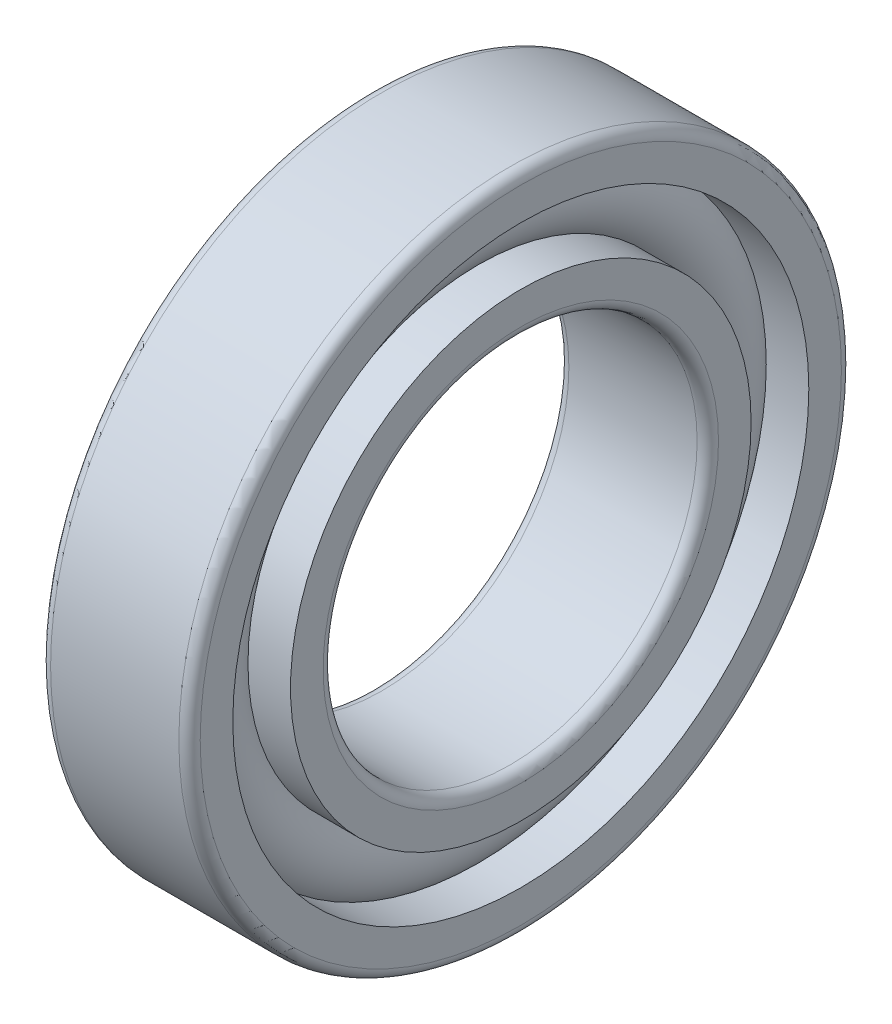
ISO-10303-21;
HEADER;
FILE_DESCRIPTION(('STEP AP214'),'2;1');
FILE_NAME('part.step','',(''),(''),'','','');
FILE_SCHEMA(('AUTOMOTIVE_DESIGN { 1 0 10303 214 1 1 1 1 }'));
ENDSEC;
DATA;
#1=APPLICATION_CONTEXT('core data for automotive mechanical design processes');
#2=APPLICATION_PROTOCOL_DEFINITION('international standard','automotive_design',2000,#1);
#3=PRODUCT_CONTEXT('',#1,'mechanical');
#4=PRODUCT('Part','Part','',(#3));
#5=PRODUCT_RELATED_PRODUCT_CATEGORY('part','',(#4));
#6=PRODUCT_DEFINITION_FORMATION('','',#4);
#7=PRODUCT_DEFINITION_CONTEXT('part definition',#1,'design');
#8=PRODUCT_DEFINITION('design','',#6,#7);
#9=PRODUCT_DEFINITION_SHAPE('','',#8);
#10=(LENGTH_UNIT() NAMED_UNIT(*) SI_UNIT(.MILLI.,.METRE.));
#11=(NAMED_UNIT(*) PLANE_ANGLE_UNIT() SI_UNIT($,.RADIAN.));
#12=(NAMED_UNIT(*) SI_UNIT($,.STERADIAN.) SOLID_ANGLE_UNIT());
#13=UNCERTAINTY_MEASURE_WITH_UNIT(LENGTH_MEASURE(1.E-05),#10,'distance_accuracy_value','');
#14=(GEOMETRIC_REPRESENTATION_CONTEXT(3) GLOBAL_UNCERTAINTY_ASSIGNED_CONTEXT((#13)) GLOBAL_UNIT_ASSIGNED_CONTEXT((#10,
#11,#12)) REPRESENTATION_CONTEXT('',''));
#15=CARTESIAN_POINT('',(0.,0.,0.));
#16=DIRECTION('',(0.,0.,1.));
#17=DIRECTION('',(1.,0.,0.));
#18=AXIS2_PLACEMENT_3D('',#15,#16,#17);
#19=CARTESIAN_POINT('',(0.,0.,0.));
#20=DIRECTION('',(-1.,0.,0.));
#21=DIRECTION('',(0.,0.,1.));
#22=AXIS2_PLACEMENT_3D('',#19,#20,#21);
#23=TOROIDAL_SURFACE('',#22,24.25,4.05);
#24=CARTESIAN_POINT('',(3.01869176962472,0.,0.));
#25=DIRECTION('',(-1.,0.,0.));
#26=DIRECTION('',(0.,0.,1.));
#27=AXIS2_PLACEMENT_3D('',#24,#25,#26);
#28=CIRCLE('',#27,26.95);
#29=CARTESIAN_POINT('',(3.01869176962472,0.,26.95));
#30=VERTEX_POINT('',#29);
#31=EDGE_CURVE('E33',#30,#30,#28,.F.);
#32=ORIENTED_EDGE('',*,*,#31,.T.);
#33=EDGE_LOOP('',(#32));
#34=FACE_BOUND('',#33,.T.);
#35=CARTESIAN_POINT('',(3.01869176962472,0.,0.));
#36=DIRECTION('',(-1.,0.,0.));
#37=DIRECTION('',(0.,0.,1.));
#38=AXIS2_PLACEMENT_3D('',#35,#36,#37);
#39=CIRCLE('',#38,21.55);
#40=CARTESIAN_POINT('',(3.01869176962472,0.,21.55));
#41=VERTEX_POINT('',#40);
#42=EDGE_CURVE('E10',#41,#41,#39,.T.);
#43=ORIENTED_EDGE('',*,*,#42,.T.);
#44=EDGE_LOOP('',(#43));
#45=FACE_BOUND('',#44,.T.);
#46=ADVANCED_FACE('F29',(#34,#45),#23,.T.);
#47=CARTESIAN_POINT('',(-20.6375,0.,0.));
#48=DIRECTION('',(1.,0.,0.));
#49=DIRECTION('',(0.,0.,-1.));
#50=AXIS2_PLACEMENT_3D('',#47,#48,#49);
#51=CYLINDRICAL_SURFACE('',#50,21.55);
#52=CARTESIAN_POINT('',(7.,0.,0.));
#53=DIRECTION('',(1.,0.,0.));
#54=DIRECTION('',(0.,0.,-1.));
#55=AXIS2_PLACEMENT_3D('',#52,#53,#54);
#56=CIRCLE('',#55,21.55);
#57=CARTESIAN_POINT('',(7.,0.,-21.55));
#58=VERTEX_POINT('',#57);
#59=EDGE_CURVE('E42',#58,#58,#56,.T.);
#60=ORIENTED_EDGE('',*,*,#59,.F.);
#61=EDGE_LOOP('',(#60));
#62=FACE_BOUND('',#61,.T.);
#63=ORIENTED_EDGE('',*,*,#42,.F.);
#64=EDGE_LOOP('',(#63));
#65=FACE_BOUND('',#64,.T.);
#66=ADVANCED_FACE('F81',(#62,#65),#51,.T.);
#67=CARTESIAN_POINT('',(-20.6375,0.,0.));
#68=DIRECTION('',(1.,0.,0.));
#69=DIRECTION('',(0.,0.,-1.));
#70=AXIS2_PLACEMENT_3D('',#67,#68,#69);
#71=CYLINDRICAL_SURFACE('',#70,21.55);
#72=CARTESIAN_POINT('',(-7.,0.,0.));
#73=DIRECTION('',(1.,0.,0.));
#74=DIRECTION('',(0.,0.,-1.));
#75=AXIS2_PLACEMENT_3D('',#72,#73,#74);
#76=CIRCLE('',#75,21.55);
#77=CARTESIAN_POINT('',(-7.,0.,-21.55));
#78=VERTEX_POINT('',#77);
#79=EDGE_CURVE('E51',#78,#78,#76,.T.);
#80=ORIENTED_EDGE('',*,*,#79,.T.);
#81=EDGE_LOOP('',(#80));
#82=FACE_BOUND('',#81,.T.);
#83=CARTESIAN_POINT('',(-3.01869176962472,0.,0.));
#84=DIRECTION('',(1.,0.,0.));
#85=DIRECTION('',(0.,0.,-1.));
#86=AXIS2_PLACEMENT_3D('',#83,#84,#85);
#87=CIRCLE('',#86,21.55);
#88=CARTESIAN_POINT('',(-3.01869176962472,0.,-21.55));
#89=VERTEX_POINT('',#88);
#90=EDGE_CURVE('E37',#89,#89,#87,.T.);
#91=ORIENTED_EDGE('',*,*,#90,.F.);
#92=EDGE_LOOP('',(#91));
#93=FACE_BOUND('',#92,.T.);
#94=ADVANCED_FACE('F84',(#82,#93),#71,.T.);
#95=CARTESIAN_POINT('',(7.,18.5,0.));
#96=DIRECTION('',(1.,0.,0.));
#97=DIRECTION('',(0.,0.,-1.));
#98=AXIS2_PLACEMENT_3D('',#95,#96,#97);
#99=PLANE('',#98);
#100=ORIENTED_EDGE('',*,*,#59,.T.);
#101=EDGE_LOOP('',(#100));
#102=FACE_BOUND('',#101,.T.);
#103=CARTESIAN_POINT('',(7.,0.,0.));
#104=DIRECTION('',(1.,0.,0.));
#105=DIRECTION('',(0.,0.,-1.));
#106=AXIS2_PLACEMENT_3D('',#103,#104,#105);
#107=CIRCLE('',#106,18.5);
#108=CARTESIAN_POINT('',(7.,0.,-18.5));
#109=VERTEX_POINT('',#108);
#110=EDGE_CURVE('E73',#109,#109,#107,.T.);
#111=ORIENTED_EDGE('',*,*,#110,.F.);
#112=EDGE_LOOP('',(#111));
#113=FACE_BOUND('',#112,.T.);
#114=ADVANCED_FACE('F78',(#102,#113),#99,.T.);
#115=CARTESIAN_POINT('',(6.,0.,0.));
#116=DIRECTION('',(1.,0.,0.));
#117=DIRECTION('',(0.,0.,-1.));
#118=AXIS2_PLACEMENT_3D('',#115,#116,#117);
#119=TOROIDAL_SURFACE('',#118,18.5,1.);
#120=ORIENTED_EDGE('',*,*,#110,.T.);
#121=EDGE_LOOP('',(#120));
#122=FACE_BOUND('',#121,.T.);
#123=CARTESIAN_POINT('',(6.,0.,0.));
#124=DIRECTION('',(1.,0.,0.));
#125=DIRECTION('',(0.,0.,-1.));
#126=AXIS2_PLACEMENT_3D('',#123,#124,#125);
#127=CIRCLE('',#126,17.5);
#128=CARTESIAN_POINT('',(6.,0.,-17.5));
#129=VERTEX_POINT('',#128);
#130=EDGE_CURVE('E70',#129,#129,#127,.T.);
#131=ORIENTED_EDGE('',*,*,#130,.F.);
#132=EDGE_LOOP('',(#131));
#133=FACE_BOUND('',#132,.T.);
#134=ADVANCED_FACE('F95',(#122,#133),#119,.T.);
#135=CARTESIAN_POINT('',(-20.6375,0.,0.));
#136=DIRECTION('',(1.,0.,0.));
#137=DIRECTION('',(0.,0.,-1.));
#138=AXIS2_PLACEMENT_3D('',#135,#136,#137);
#139=CYLINDRICAL_SURFACE('',#138,17.5);
#140=ORIENTED_EDGE('',*,*,#130,.T.);
#141=EDGE_LOOP('',(#140));
#142=FACE_BOUND('',#141,.T.);
#143=CARTESIAN_POINT('',(-6.,0.,0.));
#144=DIRECTION('',(1.,0.,0.));
#145=DIRECTION('',(0.,0.,-1.));
#146=AXIS2_PLACEMENT_3D('',#143,#144,#145);
#147=CIRCLE('',#146,17.5);
#148=CARTESIAN_POINT('',(-6.,0.,-17.5));
#149=VERTEX_POINT('',#148);
#150=EDGE_CURVE('E67',#149,#149,#147,.T.);
#151=ORIENTED_EDGE('',*,*,#150,.F.);
#152=EDGE_LOOP('',(#151));
#153=FACE_BOUND('',#152,.T.);
#154=ADVANCED_FACE('F98',(#142,#153),#139,.F.);
#155=CARTESIAN_POINT('',(-6.,0.,0.));
#156=DIRECTION('',(1.,0.,0.));
#157=DIRECTION('',(0.,0.,-1.));
#158=AXIS2_PLACEMENT_3D('',#155,#156,#157);
#159=TOROIDAL_SURFACE('',#158,18.5,1.);
#160=ORIENTED_EDGE('',*,*,#150,.T.);
#161=EDGE_LOOP('',(#160));
#162=FACE_BOUND('',#161,.T.);
#163=CARTESIAN_POINT('',(-7.,0.,0.));
#164=DIRECTION('',(1.,0.,0.));
#165=DIRECTION('',(0.,0.,-1.));
#166=AXIS2_PLACEMENT_3D('',#163,#164,#165);
#167=CIRCLE('',#166,18.5);
#168=CARTESIAN_POINT('',(-7.,0.,-18.5));
#169=VERTEX_POINT('',#168);
#170=EDGE_CURVE('E64',#169,#169,#167,.T.);
#171=ORIENTED_EDGE('',*,*,#170,.F.);
#172=EDGE_LOOP('',(#171));
#173=FACE_BOUND('',#172,.T.);
#174=ADVANCED_FACE('F102',(#162,#173),#159,.T.);
#175=CARTESIAN_POINT('',(-7.,21.55,0.));
#176=DIRECTION('',(-1.,0.,0.));
#177=DIRECTION('',(0.,0.,1.));
#178=AXIS2_PLACEMENT_3D('',#175,#176,#177);
#179=PLANE('',#178);
#180=ORIENTED_EDGE('',*,*,#170,.T.);
#181=EDGE_LOOP('',(#180));
#182=FACE_BOUND('',#181,.T.);
#183=ORIENTED_EDGE('',*,*,#79,.F.);
#184=EDGE_LOOP('',(#183));
#185=FACE_BOUND('',#184,.T.);
#186=ADVANCED_FACE('F106',(#182,#185),#179,.T.);
#187=CARTESIAN_POINT('',(-3.01869176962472,0.,0.));
#188=DIRECTION('',(1.,0.,0.));
#189=DIRECTION('',(0.,0.,-1.));
#190=AXIS2_PLACEMENT_3D('',#187,#188,#189);
#191=CIRCLE('',#190,26.95);
#192=CARTESIAN_POINT('',(-3.01869176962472,0.,-26.95));
#193=VERTEX_POINT('',#192);
#194=EDGE_CURVE('E45',#193,#193,#191,.F.);
#195=ORIENTED_EDGE('',*,*,#194,.T.);
#196=EDGE_LOOP('',(#195));
#197=FACE_BOUND('',#196,.T.);
#198=ORIENTED_EDGE('',*,*,#90,.T.);
#199=EDGE_LOOP('',(#198));
#200=FACE_BOUND('',#199,.T.);
#201=ADVANCED_FACE('F31',(#197,#200),#23,.T.);
#202=CARTESIAN_POINT('',(-20.6375,0.,0.));
#203=DIRECTION('',(1.,0.,0.));
#204=DIRECTION('',(0.,0.,-1.));
#205=AXIS2_PLACEMENT_3D('',#202,#203,#204);
#206=CYLINDRICAL_SURFACE('',#205,26.95);
#207=CARTESIAN_POINT('',(7.,0.,0.));
#208=DIRECTION('',(1.,0.,0.));
#209=DIRECTION('',(0.,0.,-1.));
#210=AXIS2_PLACEMENT_3D('',#207,#208,#209);
#211=CIRCLE('',#210,26.95);
#212=CARTESIAN_POINT('',(7.,0.,-26.95));
#213=VERTEX_POINT('',#212);
#214=EDGE_CURVE('E47',#213,#213,#211,.T.);
#215=ORIENTED_EDGE('',*,*,#214,.T.);
#216=EDGE_LOOP('',(#215));
#217=FACE_BOUND('',#216,.T.);
#218=ORIENTED_EDGE('',*,*,#31,.F.);
#219=EDGE_LOOP('',(#218));
#220=FACE_BOUND('',#219,.T.);
#221=ADVANCED_FACE('F111',(#217,#220),#206,.F.);
#222=CARTESIAN_POINT('',(-20.6375,0.,0.));
#223=DIRECTION('',(1.,0.,0.));
#224=DIRECTION('',(0.,0.,-1.));
#225=AXIS2_PLACEMENT_3D('',#222,#223,#224);
#226=CYLINDRICAL_SURFACE('',#225,26.95);
#227=CARTESIAN_POINT('',(-7.,0.,0.));
#228=DIRECTION('',(1.,0.,0.));
#229=DIRECTION('',(0.,0.,-1.));
#230=AXIS2_PLACEMENT_3D('',#227,#228,#229);
#231=CIRCLE('',#230,26.95);
#232=CARTESIAN_POINT('',(-7.,0.,-26.95));
#233=VERTEX_POINT('',#232);
#234=EDGE_CURVE('E142',#233,#233,#231,.T.);
#235=ORIENTED_EDGE('',*,*,#234,.F.);
#236=EDGE_LOOP('',(#235));
#237=FACE_BOUND('',#236,.T.);
#238=ORIENTED_EDGE('',*,*,#194,.F.);
#239=EDGE_LOOP('',(#238));
#240=FACE_BOUND('',#239,.T.);
#241=ADVANCED_FACE('F114',(#237,#240),#226,.F.);
#242=CARTESIAN_POINT('',(7.,30.,0.));
#243=DIRECTION('',(1.,0.,0.));
#244=DIRECTION('',(0.,0.,-1.));
#245=AXIS2_PLACEMENT_3D('',#242,#243,#244);
#246=PLANE('',#245);
#247=CARTESIAN_POINT('',(6.99999999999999,0.,0.));
#248=DIRECTION('',(1.,0.,0.));
#249=DIRECTION('',(0.,0.,-1.));
#250=AXIS2_PLACEMENT_3D('',#247,#248,#249);
#251=CIRCLE('',#250,30.);
#252=CARTESIAN_POINT('',(6.99999999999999,0.,-30.));
#253=VERTEX_POINT('',#252);
#254=EDGE_CURVE('E53',#253,#253,#251,.T.);
#255=ORIENTED_EDGE('',*,*,#254,.T.);
#256=EDGE_LOOP('',(#255));
#257=FACE_BOUND('',#256,.T.);
#258=ORIENTED_EDGE('',*,*,#214,.F.);
#259=EDGE_LOOP('',(#258));
#260=FACE_BOUND('',#259,.T.);
#261=ADVANCED_FACE('F115',(#257,#260),#246,.T.);
#262=CARTESIAN_POINT('',(6.,0.,0.));
#263=DIRECTION('',(1.,0.,0.));
#264=DIRECTION('',(0.,0.,-1.));
#265=AXIS2_PLACEMENT_3D('',#262,#263,#264);
#266=TOROIDAL_SURFACE('',#265,30.,0.999999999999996);
#267=CARTESIAN_POINT('',(6.,0.,0.));
#268=DIRECTION('',(1.,0.,0.));
#269=DIRECTION('',(0.,0.,-1.));
#270=AXIS2_PLACEMENT_3D('',#267,#268,#269);
#271=CIRCLE('',#270,31.);
#272=CARTESIAN_POINT('',(6.,0.,-31.));
#273=VERTEX_POINT('',#272);
#274=EDGE_CURVE('E58',#273,#273,#271,.T.);
#275=ORIENTED_EDGE('',*,*,#274,.T.);
#276=EDGE_LOOP('',(#275));
#277=FACE_BOUND('',#276,.T.);
#278=ORIENTED_EDGE('',*,*,#254,.F.);
#279=EDGE_LOOP('',(#278));
#280=FACE_BOUND('',#279,.T.);
#281=ADVANCED_FACE('F118',(#277,#280),#266,.T.);
#282=CARTESIAN_POINT('',(-20.6375,0.,0.));
#283=DIRECTION('',(1.,0.,0.));
#284=DIRECTION('',(0.,0.,-1.));
#285=AXIS2_PLACEMENT_3D('',#282,#283,#284);
#286=CYLINDRICAL_SURFACE('',#285,31.);
#287=CARTESIAN_POINT('',(-6.,0.,0.));
#288=DIRECTION('',(1.,0.,0.));
#289=DIRECTION('',(0.,0.,-1.));
#290=AXIS2_PLACEMENT_3D('',#287,#288,#289);
#291=CIRCLE('',#290,31.);
#292=CARTESIAN_POINT('',(-6.,0.,-31.));
#293=VERTEX_POINT('',#292);
#294=EDGE_CURVE('E146',#293,#293,#291,.T.);
#295=ORIENTED_EDGE('',*,*,#294,.T.);
#296=EDGE_LOOP('',(#295));
#297=FACE_BOUND('',#296,.T.);
#298=ORIENTED_EDGE('',*,*,#274,.F.);
#299=EDGE_LOOP('',(#298));
#300=FACE_BOUND('',#299,.T.);
#301=ADVANCED_FACE('F122',(#297,#300),#286,.T.);
#302=CARTESIAN_POINT('',(-6.,0.,0.));
#303=DIRECTION('',(1.,0.,0.));
#304=DIRECTION('',(0.,0.,-1.));
#305=AXIS2_PLACEMENT_3D('',#302,#303,#304);
#306=TOROIDAL_SURFACE('',#305,30.,0.999999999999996);
#307=CARTESIAN_POINT('',(-7.,0.,0.));
#308=DIRECTION('',(1.,0.,0.));
#309=DIRECTION('',(0.,0.,-1.));
#310=AXIS2_PLACEMENT_3D('',#307,#308,#309);
#311=CIRCLE('',#310,30.);
#312=CARTESIAN_POINT('',(-7.,0.,-30.));
#313=VERTEX_POINT('',#312);
#314=EDGE_CURVE('E143',#313,#313,#311,.T.);
#315=ORIENTED_EDGE('',*,*,#314,.T.);
#316=EDGE_LOOP('',(#315));
#317=FACE_BOUND('',#316,.T.);
#318=ORIENTED_EDGE('',*,*,#294,.F.);
#319=EDGE_LOOP('',(#318));
#320=FACE_BOUND('',#319,.T.);
#321=ADVANCED_FACE('F126',(#317,#320),#306,.T.);
#322=CARTESIAN_POINT('',(-7.,26.95,0.));
#323=DIRECTION('',(-1.,0.,0.));
#324=DIRECTION('',(0.,0.,1.));
#325=AXIS2_PLACEMENT_3D('',#322,#323,#324);
#326=PLANE('',#325);
#327=ORIENTED_EDGE('',*,*,#234,.T.);
#328=EDGE_LOOP('',(#327));
#329=FACE_BOUND('',#328,.T.);
#330=ORIENTED_EDGE('',*,*,#314,.F.);
#331=EDGE_LOOP('',(#330));
#332=FACE_BOUND('',#331,.T.);
#333=ADVANCED_FACE('F130',(#329,#332),#326,.T.);
#334=CLOSED_SHELL('',(#46,#66,#94,#114,#134,#154,#174,#186,#201,#221,#241,#261,#281,#301,#321,#333));
#335=MANIFOLD_SOLID_BREP('B2',#334);
#336=ADVANCED_BREP_SHAPE_REPRESENTATION('',(#18,#335),#14);
#337=SHAPE_DEFINITION_REPRESENTATION(#9,#336);
ENDSEC;
END-ISO-10303-21;
